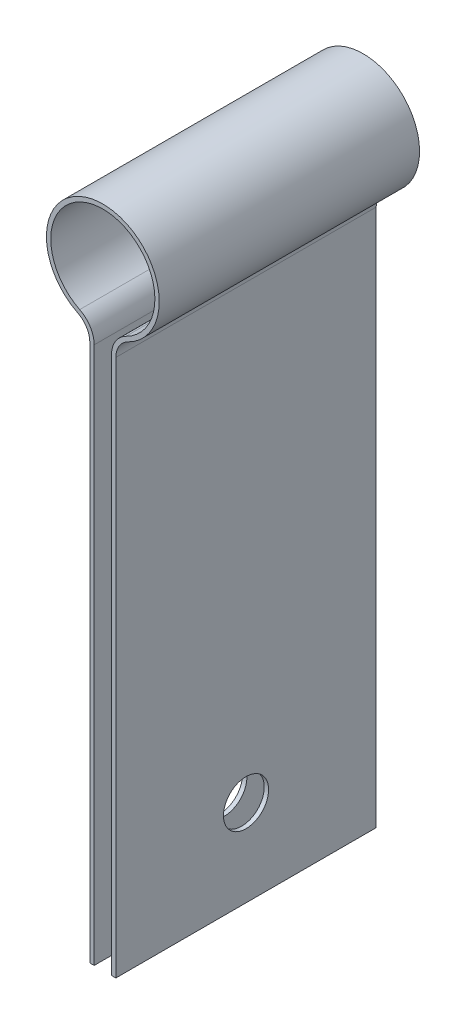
from build123d import *

# Parameters (mm, degrees)
BASE_EXTRUSION_DEPTH    = 15
ESQUISSE2_R             = 2.6
ENL_V_MAT_EXTRU_1_DEPTH = 73.034713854


with BuildPart() as part:
    # Esquisse1 → Base-Extrusion (new, symmetric)
    with BuildSketch(Plane.XY):
        with BuildLine():
            Line((-1, -8.062257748), (-1, -70))
            Line((-1, -70), (-1.5, -70))
            Line((-1.5, -70), (-1.5, -8.062257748))
            ThreePointArc((-1.5, -8.062257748), (-1.875408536, -6.744642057), (-2.888888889, -5.822741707))
            ThreePointArc((-2.888888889, -5.822741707), (0, 6.5), (2.888888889, -5.822741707))
            ThreePointArc((2.888888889, -5.822741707), (1.875408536, -6.744642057), (1.5, -8.062257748))
            Line((1.5, -8.062257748), (1.5, -70))
            Line((1.5, -70), (1, -70))
            Line((1, -70), (1, -8.062257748))
            ThreePointArc((1, -8.062257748), (1.450490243, -6.481118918), (2.666666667, -5.374838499))
            ThreePointArc((2.666666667, -5.374838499), (0, 6), (-2.666666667, -5.374838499))
            ThreePointArc((-2.666666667, -5.374838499), (-1.450490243, -6.481118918), (-1, -8.062257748))
        make_face()
    extrude(amount=BASE_EXTRUSION_DEPTH, both=True)

    # Esquisse2 → Enl_v. mat.-Extru.1 (cut, through all)
    with BuildSketch(Plane.ZY.offset(1.5)):
        with Locations(Location((0, -60, 0), (0, 0, 270))):
            Circle(ESQUISSE2_R)
    extrude(amount=-ENL_V_MAT_EXTRU_1_DEPTH, mode=Mode.SUBTRACT)


solid = part.part
